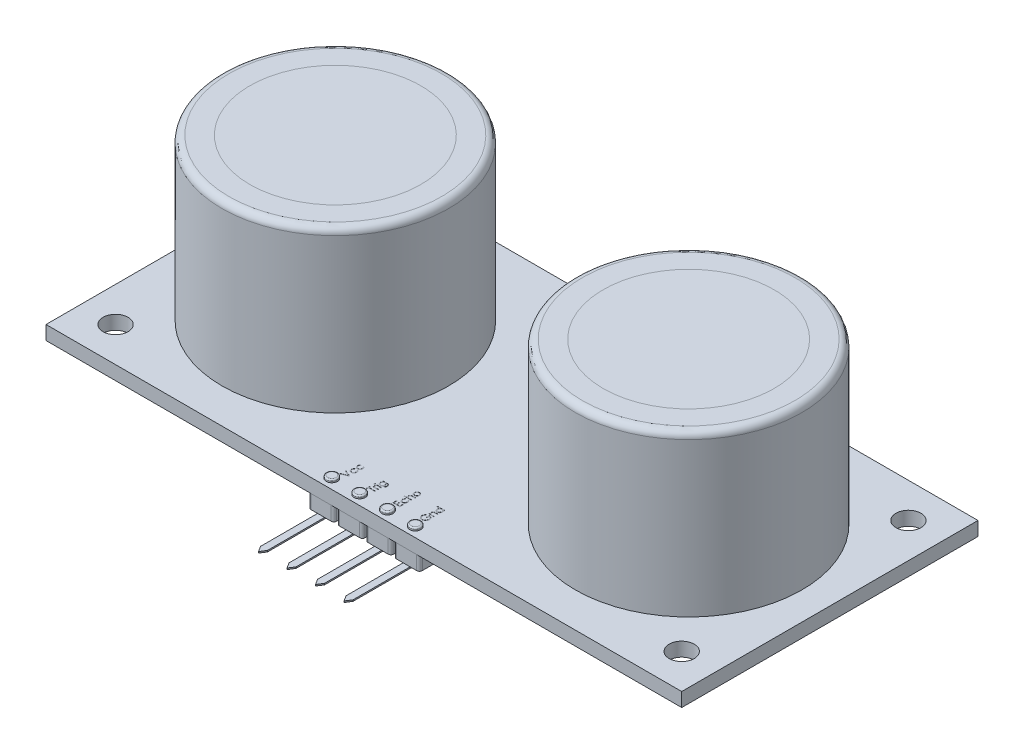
from build123d import *

# Parameters (mm, degrees)
SKETCH1_W              = 45.7
SKETCH1_H              = 21.3
SKETCH1_R              = 0.9
BOSS_EXTRUDE1_DEPTH    = 1
SKETCH2_R              = 8.15
SKETCH2_R_2            = 6.15
BOSS_EXTRUDE2_DEPTH    = 11.54
BOSS_EXTRUDE2_2_DEPTH  = 11.54
FILLET1_R              = 0.5
FILLET2_R              = 0.5
SKETCH3_R              = 6
BOSS_EXTRUDE3_DEPTH    = 7
BOSS_EXTRUDE3_2_DEPTH  = 7
LPATTERN2_COUNT        = 2
LPATTERN2_PITCH        = 25.4
SKETCH6_R              = 6.15
BOSS_EXTRUDE4_DEPTH    = 0.2
BOSS_EXTRUDE4_2_DEPTH  = 0.2
BOSS_EXTRUDE10_DEPTH   = 1
BOSS_EXTRUDE10_2_DEPTH = 1
BOSS_EXTRUDE10_3_DEPTH = 1
BOSS_EXTRUDE10_4_DEPTH = 1
SKETCH13_R             = 0.4
BOSS_EXTRUDE8_DEPTH    = 0.2
BOSS_EXTRUDE8_2_DEPTH  = 0.2
BOSS_EXTRUDE8_3_DEPTH  = 0.2
BOSS_EXTRUDE8_4_DEPTH  = 0.2
FILLET3_R              = 0.1
FILLET4_R              = 0.1
FILLET5_R              = 0.1
FILLET6_R              = 0.1
SKETCH15_W             = 0.365384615
SKETCH15_H             = 0.044871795
CUT_EXTRUDE5_DEPTH     = 0.01
BOSS_EXTRUDE11_DEPTH   = 0.1
BOSS_EXTRUDE11_2_DEPTH = 0.1
BOSS_EXTRUDE11_3_DEPTH = 0.1
BOSS_EXTRUDE11_4_DEPTH = 0.1
BOSS_EXTRUDE13_DEPTH   = 0.5
BOSS_EXTRUDE14_DEPTH   = 1.5
FILLET7_R              = 0.1


with BuildPart() as part:
    # Sketch1 → Boss-Extrude1 (new body)
    with BuildSketch(Plane(origin=(0, 0, 0), x_dir=(1, 0, 0), z_dir=(0, 1, 0))):
        Rectangle(SKETCH1_W, SKETCH1_H)
        with Locations(Location((20.35, 8.15, 0), (0, 0, 270))):
            Circle(SKETCH1_R, mode=Mode.SUBTRACT)
        with Locations(Location((-20.35, -8.15, 0), (0, 0, 270))):
            Circle(SKETCH1_R, mode=Mode.SUBTRACT)
        with Locations(Location((-20.35, 8.15, 0), (0, 0, 270))):
            Circle(SKETCH1_R, mode=Mode.SUBTRACT)
        with Locations(Location((20.35, -8.15, 0), (0, 0, 270))):
            Circle(SKETCH1_R, mode=Mode.SUBTRACT)
    extrude(amount=BOSS_EXTRUDE1_DEPTH)

    # Sketch15 → Cut-Extrude5 (cut)
    # profile 1 of 15: a face of its own
    with BuildSketch(Plane(origin=(0, 1, 0), x_dir=(1, 0, 0), z_dir=(0, 1, 0))):
        with BuildLine():
            Line((-2.771008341, -8.073076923), (-2.747671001, -8.110637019))
            add(Edge.make_bspline(
                [(-2.747671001, -8.110637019), (-2.752789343, -8.114755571), (-2.76286393, -8.122862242), (-2.775865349, -8.136939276), (-2.787032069, -8.151940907), (-2.796132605, -8.168123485), (-2.803164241, -8.185464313), (-2.808139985, -8.203895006), (-2.811240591, -8.223412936), (-2.811592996, -8.236793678), (-2.811773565, -8.24364984)],
                knots=[0, 0, 0, 0, 1.026593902, 2.0206758, 2.988051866, 3.946915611, 4.916868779, 5.907761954, 6.927957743, 8, 8, 8, 8], degree=3))
            add(Edge.make_bspline(
                [(-2.811773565, -8.24364984), (-2.811622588, -8.249129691), (-2.811325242, -8.259922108), (-2.8094666, -8.275765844), (-2.80608917, -8.290857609), (-2.801639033, -8.305291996), (-2.795674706, -8.318966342), (-2.78841617, -8.331916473), (-2.779980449, -8.344257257), (-2.770207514, -8.355631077), (-2.759579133, -8.366035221), (-2.748185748, -8.375049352), (-2.736368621, -8.382897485), (-2.723832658, -8.389055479), (-2.71086465, -8.394094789), (-2.697219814, -8.397410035), (-2.683072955, -8.399619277), (-2.673427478, -8.399872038), (-2.668544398, -8.4)],
                knots=[0, 0, 0, 0, 1.112346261, 2.190735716, 3.231507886, 4.247384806, 5.251966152, 6.253067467, 7.256802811, 8.280671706, 9.291813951, 10.270744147, 11.225547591, 12.165006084, 13.100104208, 14.043489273, 15.009504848, 16, 16, 16, 16], degree=3))
            add(Edge.make_bspline(
                [(-2.668544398, -8.4), (-2.662149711, -8.399741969), (-2.649413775, -8.399228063), (-2.630645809, -8.395319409), (-2.612533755, -8.388779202), (-2.595175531, -8.379943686), (-2.579092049, -8.368728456), (-2.564665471, -8.355562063), (-2.552177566, -8.340430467), (-2.541824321, -8.323468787), (-2.533501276, -8.305074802), (-2.527571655, -8.28544765), (-2.523992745, -8.26474768), (-2.523541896, -8.250575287), (-2.523312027, -8.243349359)],
                knots=[0, 0, 0, 0, 0.96628757, 1.924499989, 2.884001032, 3.87047137, 4.860396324, 5.839257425, 6.814467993, 7.816059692, 8.834901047, 9.858382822, 10.908076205, 12, 12, 12, 12], degree=3))
            add(Edge.make_bspline(
                [(-2.523312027, -8.243349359), (-2.523497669, -8.23672719), (-2.523862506, -8.22371287), (-2.526938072, -8.204688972), (-2.531972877, -8.186577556), (-2.53899397, -8.169379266), (-2.548069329, -8.153125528), (-2.559263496, -8.13792136), (-2.572254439, -8.123464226), (-2.582299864, -8.114964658), (-2.587414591, -8.110637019)],
                knots=[0, 0, 0, 0, 1.039848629, 2.043578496, 3.018386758, 3.987534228, 4.954977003, 5.934852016, 6.948509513, 8, 8, 8, 8], degree=3))
            Line((-2.587414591, -8.110637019), (-2.562775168, -8.073076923))
            add(Edge.make_bspline(
                [(-2.562775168, -8.073076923), (-2.559505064, -8.075303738), (-2.55297571, -8.079749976), (-2.543769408, -8.087182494), (-2.535152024, -8.095199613), (-2.527135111, -8.103770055), (-2.519526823, -8.112781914), (-2.512690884, -8.122543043), (-2.506243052, -8.132738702), (-2.500441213, -8.143488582), (-2.495226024, -8.154681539), (-2.490741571, -8.166301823), (-2.486888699, -8.178298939), (-2.483826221, -8.190686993), (-2.481381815, -8.203490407), (-2.479759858, -8.216676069), (-2.478549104, -8.230239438), (-2.478476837, -8.239406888), (-2.478440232, -8.244050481)],
                knots=[0, 0, 0, 0, 0.954134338, 1.905101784, 2.851144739, 3.791306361, 4.734911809, 5.6936923, 6.663572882, 7.643865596, 8.638447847, 9.640600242, 10.646758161, 11.676244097, 12.717260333, 13.78922464, 14.880174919, 16, 16, 16, 16], degree=3))
            add(Edge.make_bspline(
                [(-2.478440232, -8.244050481), (-2.478567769, -8.251137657), (-2.478817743, -8.265028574), (-2.481558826, -8.285361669), (-2.485706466, -8.304787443), (-2.491608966, -8.323340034), (-2.499403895, -8.340906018), (-2.508707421, -8.357631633), (-2.519826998, -8.373344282), (-2.532498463, -8.387940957), (-2.546251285, -8.401289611), (-2.561005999, -8.41290504), (-2.576436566, -8.422748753), (-2.592640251, -8.430857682), (-2.60955061, -8.437198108), (-2.627270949, -8.441563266), (-2.645650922, -8.444379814), (-2.658184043, -8.444706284), (-2.664537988, -8.444871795)],
                knots=[0, 0, 0, 0, 1.113096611, 2.181677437, 3.217994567, 4.231807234, 5.234933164, 6.233258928, 7.234764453, 8.254006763, 9.267004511, 10.242118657, 11.199842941, 12.138404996, 13.084707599, 14.031460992, 15.002005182, 16, 16, 16, 16], degree=3))
            add(Edge.make_bspline(
                [(-2.664537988, -8.444871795), (-2.668849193, -8.444808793), (-2.677424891, -8.444683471), (-2.690152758, -8.443246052), (-2.702711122, -8.441389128), (-2.714940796, -8.438242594), (-2.727027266, -8.434608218), (-2.738824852, -8.429968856), (-2.750388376, -8.424526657), (-2.761688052, -8.418347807), (-2.772537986, -8.411392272), (-2.78278851, -8.403694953), (-2.792562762, -8.395545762), (-2.801523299, -8.386563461), (-2.810028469, -8.377129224), (-2.817851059, -8.366976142), (-2.825014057, -8.356162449), (-2.831649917, -8.344850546), (-2.837558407, -8.333047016), (-2.84264887, -8.320823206), (-2.846999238, -8.308252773), (-2.850443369, -8.295315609), (-2.853331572, -8.282097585), (-2.855148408, -8.268494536), (-2.856432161, -8.254558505), (-2.856573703, -8.24512193), (-2.85664536, -8.240344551)],
                knots=[0, 0, 0, 0, 0.990994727, 1.971252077, 2.943264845, 3.907940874, 4.872158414, 5.844625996, 6.82015047, 7.809835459, 8.804511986, 9.781214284, 10.756496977, 11.728388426, 12.696359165, 13.676225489, 14.672885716, 15.677705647, 16.690706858, 17.706033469, 18.721040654, 19.747369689, 20.783475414, 21.830280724, 22.901553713, 24, 24, 24, 24], degree=3))
            add(Edge.make_bspline(
                [(-2.85664536, -8.240344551), (-2.856513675, -8.234361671), (-2.856250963, -8.222425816), (-2.854039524, -8.204720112), (-2.850706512, -8.187274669), (-2.84576471, -8.170398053), (-2.839794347, -8.154285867), (-2.833049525, -8.139243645), (-2.825383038, -8.125498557), (-2.816841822, -8.112929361), (-2.807112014, -8.101539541), (-2.796292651, -8.091037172), (-2.784305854, -8.081353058), (-2.775477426, -8.075858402), (-2.771008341, -8.073076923)],
                knots=[0, 0, 0, 0, 1.095139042, 2.184804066, 3.262657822, 4.34424993, 5.400369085, 6.407210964, 7.359649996, 8.278719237, 9.185177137, 10.097389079, 11.036869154, 12, 12, 12, 12], degree=3))
        make_face()
    # profile 2 of 15: a face of its own
    with BuildSketch(Plane(origin=(0, 1, 0), x_dir=(1, 0, 0), z_dir=(0, 1, 0))):
        with BuildLine():
            Line((-2.771008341, -8.521794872), (-2.747671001, -8.559354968))
            add(Edge.make_bspline(
                [(-2.747671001, -8.559354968), (-2.752789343, -8.56347352), (-2.76286393, -8.571580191), (-2.775865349, -8.585657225), (-2.787032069, -8.600658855), (-2.796132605, -8.616841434), (-2.803164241, -8.634182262), (-2.808139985, -8.652612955), (-2.811240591, -8.672130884), (-2.811592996, -8.685511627), (-2.811773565, -8.692367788)],
                knots=[0, 0, 0, 0, 1.026593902, 2.0206758, 2.988051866, 3.946915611, 4.916868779, 5.907761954, 6.927957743, 8, 8, 8, 8], degree=3))
            add(Edge.make_bspline(
                [(-2.811773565, -8.692367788), (-2.811622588, -8.697847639), (-2.811325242, -8.708640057), (-2.8094666, -8.724483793), (-2.80608917, -8.739575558), (-2.801639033, -8.754009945), (-2.795674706, -8.76768429), (-2.78841617, -8.780634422), (-2.779980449, -8.792975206), (-2.770207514, -8.804349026), (-2.759579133, -8.81475317), (-2.748185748, -8.823767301), (-2.736368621, -8.831615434), (-2.723832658, -8.837773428), (-2.71086465, -8.842812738), (-2.697219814, -8.846127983), (-2.683072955, -8.848337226), (-2.673427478, -8.848589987), (-2.668544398, -8.848717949)],
                knots=[0, 0, 0, 0, 1.112346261, 2.190735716, 3.231507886, 4.247384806, 5.251966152, 6.253067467, 7.256802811, 8.280671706, 9.291813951, 10.270744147, 11.225547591, 12.165006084, 13.100104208, 14.043489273, 15.009504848, 16, 16, 16, 16], degree=3))
            add(Edge.make_bspline(
                [(-2.668544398, -8.848717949), (-2.662149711, -8.848459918), (-2.649413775, -8.847946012), (-2.630645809, -8.844037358), (-2.612533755, -8.837497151), (-2.595175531, -8.828661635), (-2.579092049, -8.817446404), (-2.564665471, -8.804280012), (-2.552177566, -8.789148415), (-2.541824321, -8.772186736), (-2.533501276, -8.75379275), (-2.527571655, -8.734165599), (-2.523992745, -8.713465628), (-2.523541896, -8.699293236), (-2.523312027, -8.692067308)],
                knots=[0, 0, 0, 0, 0.96628757, 1.924499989, 2.884001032, 3.87047137, 4.860396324, 5.839257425, 6.814467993, 7.816059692, 8.834901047, 9.858382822, 10.908076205, 12, 12, 12, 12], degree=3))
            add(Edge.make_bspline(
                [(-2.523312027, -8.692067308), (-2.523497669, -8.685445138), (-2.523862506, -8.672430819), (-2.526938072, -8.653406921), (-2.531972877, -8.635295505), (-2.53899397, -8.618097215), (-2.548069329, -8.601843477), (-2.559263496, -8.586639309), (-2.572254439, -8.572182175), (-2.582299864, -8.563682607), (-2.587414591, -8.559354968)],
                knots=[0, 0, 0, 0, 1.039848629, 2.043578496, 3.018386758, 3.987534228, 4.954977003, 5.934852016, 6.948509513, 8, 8, 8, 8], degree=3))
            Line((-2.587414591, -8.559354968), (-2.562775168, -8.521794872))
            add(Edge.make_bspline(
                [(-2.562775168, -8.521794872), (-2.559505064, -8.524021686), (-2.55297571, -8.528467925), (-2.543769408, -8.535900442), (-2.535152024, -8.543917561), (-2.527135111, -8.552488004), (-2.519526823, -8.561499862), (-2.512690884, -8.571260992), (-2.506243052, -8.581456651), (-2.500441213, -8.592206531), (-2.495226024, -8.603399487), (-2.490741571, -8.615019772), (-2.486888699, -8.627016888), (-2.483826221, -8.639404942), (-2.481381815, -8.652208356), (-2.479759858, -8.665394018), (-2.478549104, -8.678957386), (-2.478476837, -8.688124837), (-2.478440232, -8.692768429)],
                knots=[0, 0, 0, 0, 0.954134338, 1.905101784, 2.851144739, 3.791306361, 4.734911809, 5.6936923, 6.663572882, 7.643865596, 8.638447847, 9.640600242, 10.646758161, 11.676244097, 12.717260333, 13.78922464, 14.880174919, 16, 16, 16, 16], degree=3))
            add(Edge.make_bspline(
                [(-2.478440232, -8.692768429), (-2.478567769, -8.699855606), (-2.478817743, -8.713746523), (-2.481558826, -8.734079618), (-2.485706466, -8.753505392), (-2.491608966, -8.772057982), (-2.499403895, -8.789623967), (-2.508707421, -8.806349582), (-2.519826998, -8.82206223), (-2.532498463, -8.836658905), (-2.546251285, -8.85000756), (-2.561005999, -8.861622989), (-2.576436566, -8.871466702), (-2.592640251, -8.879575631), (-2.60955061, -8.885916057), (-2.627270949, -8.890281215), (-2.645650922, -8.893097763), (-2.658184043, -8.893424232), (-2.664537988, -8.893589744)],
                knots=[0, 0, 0, 0, 1.113096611, 2.181677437, 3.217994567, 4.231807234, 5.234933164, 6.233258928, 7.234764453, 8.254006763, 9.267004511, 10.242118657, 11.199842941, 12.138404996, 13.084707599, 14.031460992, 15.002005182, 16, 16, 16, 16], degree=3))
            add(Edge.make_bspline(
                [(-2.664537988, -8.893589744), (-2.668849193, -8.893526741), (-2.677424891, -8.893401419), (-2.690152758, -8.891964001), (-2.702711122, -8.890107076), (-2.714940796, -8.886960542), (-2.727027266, -8.883326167), (-2.738824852, -8.878686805), (-2.750388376, -8.873244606), (-2.761688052, -8.867065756), (-2.772537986, -8.860110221), (-2.78278851, -8.852412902), (-2.792562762, -8.844263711), (-2.801523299, -8.835281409), (-2.810028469, -8.825847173), (-2.817851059, -8.815694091), (-2.825014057, -8.804880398), (-2.831649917, -8.793568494), (-2.837558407, -8.781764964), (-2.84264887, -8.769541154), (-2.846999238, -8.756970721), (-2.850443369, -8.744033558), (-2.853331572, -8.730815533), (-2.855148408, -8.717212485), (-2.856432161, -8.703276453), (-2.856573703, -8.693839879), (-2.85664536, -8.6890625)],
                knots=[0, 0, 0, 0, 0.990994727, 1.971252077, 2.943264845, 3.907940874, 4.872158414, 5.844625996, 6.82015047, 7.809835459, 8.804511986, 9.781214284, 10.756496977, 11.728388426, 12.696359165, 13.676225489, 14.672885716, 15.677705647, 16.690706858, 17.706033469, 18.721040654, 19.747369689, 20.783475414, 21.830280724, 22.901553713, 24, 24, 24, 24], degree=3))
            add(Edge.make_bspline(
                [(-2.85664536, -8.6890625), (-2.856513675, -8.68307962), (-2.856250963, -8.671143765), (-2.854039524, -8.65343806), (-2.850706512, -8.635992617), (-2.84576471, -8.619116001), (-2.839794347, -8.603003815), (-2.833049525, -8.587961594), (-2.825383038, -8.574216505), (-2.816841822, -8.561647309), (-2.807112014, -8.550257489), (-2.796292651, -8.539755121), (-2.784305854, -8.530071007), (-2.775477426, -8.524576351), (-2.771008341, -8.521794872)],
                knots=[0, 0, 0, 0, 1.095139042, 2.184804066, 3.262657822, 4.34424993, 5.400369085, 6.407210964, 7.359649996, 8.278719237, 9.185177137, 10.097389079, 11.036869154, 12, 12, 12, 12], degree=3))
        make_face()
    # profile 3 of 15: a face of its own
    with BuildSketch(Plane(origin=(0, 1, 0), x_dir=(1, 0, 0), z_dir=(0, 1, 0))):
        Polygon((-2.984850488, -9.393589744), (-2.984850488, -9.345512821), (-2.590820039, -9.178846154), (-2.984850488, -9.012179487), (-2.984850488, -8.964102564), (-2.484850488, -9.175641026), (-2.484850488, -9.182051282), align=None)
    # profile 4 of 15: a face of its own
    with BuildSketch(Plane(origin=(0, 1, 0), x_dir=(1, 0, 0), z_dir=(0, 1, 0))):
        with BuildLine():
            Line((-0.997671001, -8.323076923), (-0.997671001, -8.278205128))
            Line((-0.997671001, -8.278205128), (-0.707707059, -8.278205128))
            add(Edge.make_bspline(
                [(-0.707707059, -8.278205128), (-0.701530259, -8.278244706), (-0.689607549, -8.2783211), (-0.672367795, -8.278871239), (-0.656444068, -8.280031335), (-0.641763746, -8.281346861), (-0.628394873, -8.283239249), (-0.616297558, -8.285550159), (-0.605460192, -8.288155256), (-0.598785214, -8.290443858), (-0.595627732, -8.291526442)],
                knots=[0, 0, 0, 0, 1.307562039, 2.523909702, 3.650326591, 4.686913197, 5.643429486, 6.506965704, 7.293745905, 8, 8, 8, 8], degree=3))
            add(Edge.make_bspline(
                [(-0.595627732, -8.291526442), (-0.591523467, -8.293124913), (-0.583437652, -8.29627406), (-0.571975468, -8.302171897), (-0.561183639, -8.308777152), (-0.551119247, -8.316319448), (-0.54184421, -8.324773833), (-0.533128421, -8.333892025), (-0.525299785, -8.343993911), (-0.518264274, -8.354902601), (-0.511803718, -8.366397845), (-0.50629187, -8.378566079), (-0.501694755, -8.391341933), (-0.497912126, -8.404666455), (-0.494860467, -8.418538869), (-0.492824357, -8.433005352), (-0.49145333, -8.448017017), (-0.491325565, -8.458223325), (-0.491260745, -8.463401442)],
                knots=[0, 0, 0, 0, 0.98202571, 1.934689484, 2.871054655, 3.802072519, 4.735470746, 5.668036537, 6.612630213, 7.581518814, 8.561763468, 9.551722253, 10.55777311, 11.588015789, 12.63986657, 13.723744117, 14.845153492, 16, 16, 16, 16], degree=3))
            add(Edge.make_bspline(
                [(-0.491260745, -8.463401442), (-0.491398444, -8.470954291), (-0.491667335, -8.485703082), (-0.494237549, -8.507250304), (-0.498383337, -8.527647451), (-0.504290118, -8.546745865), (-0.51159439, -8.564353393), (-0.519961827, -8.580371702), (-0.529561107, -8.594653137), (-0.540489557, -8.607527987), (-0.553484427, -8.619148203), (-0.56879853, -8.630080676), (-0.586665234, -8.640603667), (-0.599778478, -8.646770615), (-0.60664536, -8.65)],
                knots=[0, 0, 0, 0, 1.157856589, 2.260999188, 3.322382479, 4.345906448, 5.321474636, 6.242187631, 7.112686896, 7.955149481, 8.825136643, 9.778649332, 10.836767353, 12, 12, 12, 12], degree=3))
            Line((-0.60664536, -8.65), (-0.60664536, -8.605128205))
            add(Edge.make_bspline(
                [(-0.60664536, -8.605128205), (-0.600917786, -8.601517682), (-0.589721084, -8.594459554), (-0.575209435, -8.581304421), (-0.562921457, -8.566781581), (-0.552951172, -8.55058289), (-0.545275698, -8.53259537), (-0.539944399, -8.512702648), (-0.536718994, -8.490850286), (-0.536333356, -8.475632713), (-0.536132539, -8.467708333)],
                knots=[0, 0, 0, 0, 0.997887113, 1.950746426, 2.877762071, 3.798308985, 4.747694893, 5.754452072, 6.830656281, 8, 8, 8, 8], degree=3))
            add(Edge.make_bspline(
                [(-0.536132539, -8.467708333), (-0.536335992, -8.459884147), (-0.536728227, -8.4447999), (-0.53994568, -8.423114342), (-0.545277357, -8.403286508), (-0.552935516, -8.38553539), (-0.562134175, -8.369971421), (-0.57230764, -8.356477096), (-0.583915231, -8.345633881), (-0.594592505, -8.338312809), (-0.604111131, -8.333766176), (-0.61230383, -8.330868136), (-0.621538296, -8.328530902), (-0.631836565, -8.326524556), (-0.643202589, -8.324934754), (-0.65567513, -8.323891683), (-0.669169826, -8.323151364), (-0.678525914, -8.32310231), (-0.683368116, -8.323076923)],
                knots=[0, 0, 0, 0, 1.570880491, 3.028500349, 4.391799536, 5.683507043, 6.897971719, 8.016608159, 9.065046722, 10.074948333, 10.602832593, 11.179761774, 11.817338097, 12.514350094, 13.286299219, 14.121078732, 15.027572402, 16, 16, 16, 16], degree=3))
            Line((-0.683368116, -8.323076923), (-0.702298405, -8.323076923))
            add(Edge.make_bspline(
                [(-0.702298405, -8.323076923), (-0.696880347, -8.327632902), (-0.686139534, -8.336664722), (-0.672040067, -8.3522204), (-0.660043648, -8.369318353), (-0.650065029, -8.387716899), (-0.642159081, -8.407141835), (-0.636430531, -8.427249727), (-0.632877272, -8.447984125), (-0.632484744, -8.462018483), (-0.632286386, -8.469110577)],
                knots=[0, 0, 0, 0, 1.012670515, 2.007528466, 2.995541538, 3.996581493, 4.997861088, 5.991949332, 6.98525577, 8, 8, 8, 8], degree=3))
            add(Edge.make_bspline(
                [(-0.632286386, -8.469110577), (-0.632374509, -8.473285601), (-0.632549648, -8.481583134), (-0.63361503, -8.493945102), (-0.635689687, -8.506068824), (-0.638346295, -8.51803153), (-0.641907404, -8.529749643), (-0.646087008, -8.54136357), (-0.651220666, -8.552704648), (-0.657000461, -8.563830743), (-0.663494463, -8.574480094), (-0.670510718, -8.584619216), (-0.67803427, -8.594185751), (-0.686133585, -8.603091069), (-0.694798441, -8.611322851), (-0.703936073, -8.618991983), (-0.713674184, -8.625971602), (-0.723835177, -8.632404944), (-0.734486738, -8.637984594), (-0.745397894, -8.642882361), (-0.756545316, -8.647140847), (-0.767966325, -8.650535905), (-0.779653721, -8.653128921), (-0.791588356, -8.655058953), (-0.803806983, -8.656153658), (-0.812038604, -8.656324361), (-0.816180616, -8.656410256)],
                knots=[0, 0, 0, 0, 1.028710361, 2.044481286, 3.053267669, 4.056977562, 5.061496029, 6.068537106, 7.095799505, 8.125955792, 9.155750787, 10.166547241, 11.162135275, 12.151998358, 13.129411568, 14.10464185, 15.088574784, 16.079052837, 17.065149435, 18.048153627, 19.024354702, 20.002874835, 20.980703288, 21.971932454, 22.97951087, 24, 24, 24, 24], degree=3))
            add(Edge.make_bspline(
                [(-0.816180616, -8.656410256), (-0.820323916, -8.65633609), (-0.828594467, -8.656188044), (-0.840862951, -8.654909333), (-0.852967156, -8.653085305), (-0.864782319, -8.650198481), (-0.876442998, -8.646723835), (-0.887863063, -8.642420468), (-0.899045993, -8.637246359), (-0.910000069, -8.631387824), (-0.920578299, -8.624804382), (-0.930624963, -8.617585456), (-0.94006613, -8.609722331), (-0.948997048, -8.601323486), (-0.957331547, -8.592286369), (-0.965049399, -8.582615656), (-0.972279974, -8.572406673), (-0.978867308, -8.56162778), (-0.984693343, -8.550445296), (-0.990009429, -8.539143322), (-0.994228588, -8.527572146), (-0.997946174, -8.515947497), (-1.000579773, -8.504064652), (-1.002611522, -8.49206931), (-1.003849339, -8.479920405), (-1.004003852, -8.471784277), (-1.004081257, -8.467708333)],
                knots=[0, 0, 0, 0, 1.008818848, 2.013730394, 3.001654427, 3.987803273, 4.973046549, 5.963777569, 6.957074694, 7.972068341, 8.987420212, 9.989399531, 10.982630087, 11.977756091, 12.973280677, 13.973972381, 14.989194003, 16.018387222, 17.047741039, 18.059210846, 19.057554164, 20.045176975, 21.029480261, 22.018708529, 23.007435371, 24, 24, 24, 24], degree=3))
            add(Edge.make_bspline(
                [(-1.004081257, -8.467708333), (-1.003887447, -8.460986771), (-1.003504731, -8.44771375), (-1.00050171, -8.428180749), (-0.995713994, -8.409331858), (-0.988854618, -8.391060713), (-0.979490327, -8.373218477), (-0.96715562, -8.355863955), (-0.951739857, -8.338946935), (-0.939918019, -8.328507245), (-0.933768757, -8.323076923)],
                knots=[0, 0, 0, 0, 0.96728863, 1.910097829, 2.838038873, 3.762875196, 4.71315279, 5.730631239, 6.819562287, 8, 8, 8, 8], degree=3))
            Line((-0.933768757, -8.323076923), (-0.997671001, -8.323076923))
        make_face()
        with BuildLine():
            add(Edge.make_bspline(
                [(-0.959209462, -8.464102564), (-0.958985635, -8.470663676), (-0.958542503, -8.483653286), (-0.954785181, -8.502700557), (-0.948838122, -8.521046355), (-0.940560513, -8.538509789), (-0.930099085, -8.55468857), (-0.917652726, -8.569167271), (-0.903392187, -8.581790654), (-0.887501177, -8.592471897), (-0.87033042, -8.601004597), (-0.852239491, -8.606965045), (-0.83354441, -8.610904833), (-0.820807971, -8.611325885), (-0.814377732, -8.611538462)],
                knots=[0, 0, 0, 0, 1.026191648, 2.031641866, 3.026511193, 4.038688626, 5.047555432, 6.033268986, 7.01798463, 8.019529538, 9.022150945, 10.008736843, 10.994672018, 12, 12, 12, 12], degree=3))
            add(Edge.make_bspline(
                [(-0.814377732, -8.611538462), (-0.809530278, -8.611434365), (-0.799996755, -8.611229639), (-0.786003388, -8.609275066), (-0.772655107, -8.606077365), (-0.759964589, -8.601659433), (-0.747930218, -8.59601418), (-0.736552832, -8.589051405), (-0.725826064, -8.58080999), (-0.71584043, -8.571403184), (-0.70674619, -8.561034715), (-0.698754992, -8.549789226), (-0.692219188, -8.537681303), (-0.686570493, -8.52500891), (-0.682444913, -8.511464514), (-0.679296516, -8.497243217), (-0.677495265, -8.482244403), (-0.677272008, -8.472019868), (-0.67715818, -8.466806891)],
                knots=[0, 0, 0, 0, 1.039710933, 2.044807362, 3.024849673, 3.981007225, 4.923240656, 5.871799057, 6.837597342, 7.820855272, 8.810901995, 9.792827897, 10.773995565, 11.758948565, 12.765014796, 13.806304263, 14.881544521, 16, 16, 16, 16], degree=3))
            add(Edge.make_bspline(
                [(-0.67715818, -8.466806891), (-0.677267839, -8.461526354), (-0.677482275, -8.45120032), (-0.679325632, -8.436118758), (-0.6823002, -8.421828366), (-0.686523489, -8.408342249), (-0.691912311, -8.395609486), (-0.698731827, -8.383773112), (-0.706498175, -8.372579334), (-0.715557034, -8.362385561), (-0.725540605, -8.353167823), (-0.736404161, -8.345134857), (-0.747984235, -8.338289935), (-0.760279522, -8.332621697), (-0.773385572, -8.328294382), (-0.787269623, -8.325391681), (-0.801865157, -8.323362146), (-0.811866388, -8.323173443), (-0.816981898, -8.323076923)],
                knots=[0, 0, 0, 0, 1.121943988, 2.193949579, 3.223793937, 4.220241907, 5.192961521, 6.155822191, 7.11847367, 8.083710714, 9.04790392, 10.001595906, 10.949595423, 11.902125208, 12.873731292, 13.87582262, 14.913508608, 16, 16, 16, 16], degree=3))
            add(Edge.make_bspline(
                [(-0.816981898, -8.323076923), (-0.82364145, -8.323268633), (-0.836651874, -8.323643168), (-0.85561197, -8.327166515), (-0.873457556, -8.33288198), (-0.890142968, -8.34081413), (-0.905435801, -8.350799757), (-0.918948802, -8.362944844), (-0.931054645, -8.376711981), (-0.941008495, -8.392437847), (-0.949122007, -8.409269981), (-0.955011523, -8.426960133), (-0.958478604, -8.445337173), (-0.958964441, -8.457811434), (-0.959209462, -8.464102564)],
                knots=[0, 0, 0, 0, 1.070678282, 2.091729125, 3.090678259, 4.078281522, 5.055707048, 6.018451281, 6.993304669, 7.996175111, 9.002951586, 9.993356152, 10.987991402, 12, 12, 12, 12], degree=3))
        make_face(mode=Mode.SUBTRACT)
    # profile 5 of 15: a face of its own
    with BuildSketch(Plane(origin=(0, 1, 0), x_dir=(1, 0, 0), z_dir=(0, 1, 0))):
        with BuildLine():
            add(Edge.make_bspline(
                [(-1.151517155, -8.768790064), (-1.15138799, -8.76600559), (-1.151135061, -8.760553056), (-1.148969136, -8.752668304), (-1.145297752, -8.74548873), (-1.140372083, -8.739120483), (-1.134579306, -8.733655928), (-1.127827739, -8.729830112), (-1.120533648, -8.727371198), (-1.115445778, -8.727074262), (-1.112855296, -8.726923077)],
                knots=[0, 0, 0, 0, 1.055194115, 2.066272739, 3.074728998, 4.095836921, 5.109056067, 6.073838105, 7.019297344, 8, 8, 8, 8], degree=3))
            add(Edge.make_bspline(
                [(-1.112855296, -8.726923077), (-1.11033206, -8.727077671), (-1.10534392, -8.727383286), (-1.098176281, -8.729828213), (-1.091518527, -8.733688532), (-1.085736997, -8.739116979), (-1.080814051, -8.745489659), (-1.077141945, -8.752668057), (-1.074976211, -8.760553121), (-1.074723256, -8.766005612), (-1.074594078, -8.768790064)],
                knots=[0, 0, 0, 0, 0.96129708, 1.900370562, 2.859976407, 3.87933698, 4.906634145, 5.921202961, 6.938410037, 8, 8, 8, 8], degree=3))
            add(Edge.make_bspline(
                [(-1.074594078, -8.768790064), (-1.074718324, -8.771542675), (-1.074960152, -8.776900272), (-1.07718444, -8.784666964), (-1.080815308, -8.791785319), (-1.085704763, -8.798165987), (-1.091554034, -8.803484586), (-1.098172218, -8.807355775), (-1.105344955, -8.809795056), (-1.110332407, -8.810101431), (-1.112855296, -8.81025641)],
                knots=[0, 0, 0, 0, 1.054934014, 2.053291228, 3.073705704, 4.106921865, 5.123545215, 6.088680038, 7.033164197, 8, 8, 8, 8], degree=3))
            add(Edge.make_bspline(
                [(-1.112855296, -8.81025641), (-1.115445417, -8.810104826), (-1.120532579, -8.809807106), (-1.127831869, -8.807353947), (-1.134543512, -8.803516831), (-1.140404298, -8.798162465), (-1.145296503, -8.791786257), (-1.148926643, -8.784666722), (-1.15115112, -8.776900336), (-1.151392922, -8.771542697), (-1.151517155, -8.768790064)],
                knots=[0, 0, 0, 0, 0.98631895, 1.937192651, 2.907499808, 3.917963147, 4.944918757, 5.95915025, 6.951458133, 8, 8, 8, 8], degree=3))
        make_face()
    # profile 6 of 15: a face of its own
    with BuildSketch(Plane(origin=(0, 1, 0), x_dir=(1, 0, 0), z_dir=(0, 1, 0))):
        with Locations((-0.814978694, -8.768589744)):
            Rectangle(SKETCH15_W, SKETCH15_H)
    # profile 7 of 15: a face of its own
    with BuildSketch(Plane(origin=(0, 1, 0), x_dir=(1, 0, 0), z_dir=(0, 1, 0))):
        with BuildLine():
            Line((-0.997671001, -9.008974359), (-0.997671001, -8.964102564))
            Line((-0.997671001, -8.964102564), (-0.943884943, -8.964102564))
            add(Edge.make_bspline(
                [(-0.943884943, -8.964102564), (-0.948895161, -8.960792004), (-0.958477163, -8.954460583), (-0.971132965, -8.943887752), (-0.98173113, -8.933173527), (-0.990069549, -8.922036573), (-0.996371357, -8.910586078), (-1.00079944, -8.898918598), (-1.003545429, -8.887005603), (-1.003902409, -8.878980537), (-1.004081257, -8.874959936)],
                knots=[0, 0, 0, 0, 1.280091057, 2.448164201, 3.510831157, 4.48793739, 5.405868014, 6.289422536, 7.142991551, 8, 8, 8, 8], degree=3))
            add(Edge.make_bspline(
                [(-1.004081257, -8.874959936), (-1.003911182, -8.871841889), (-1.003561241, -8.865426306), (-1.001102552, -8.855714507), (-0.99717712, -8.8457083), (-0.99348566, -8.839259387), (-0.991561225, -8.835897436)],
                knots=[0, 0, 0, 0, 0.901110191, 1.854092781, 2.881294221, 4, 4, 4, 4], degree=3))
            Line((-0.991561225, -8.835897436), (-0.952699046, -8.860536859))
            add(Edge.make_bspline(
                [(-0.952699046, -8.860536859), (-0.953661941, -8.862695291), (-0.9554897, -8.866792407), (-0.957652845, -8.872785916), (-0.958926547, -8.878311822), (-0.959119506, -8.88183233), (-0.959209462, -8.883473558)],
                knots=[0, 0, 0, 0, 1.180555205, 2.24091978, 3.179933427, 4, 4, 4, 4], degree=3))
            add(Edge.make_bspline(
                [(-0.959209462, -8.883473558), (-0.958971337, -8.887075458), (-0.958485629, -8.89442229), (-0.954612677, -8.905172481), (-0.948535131, -8.915697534), (-0.941614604, -8.923975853), (-0.934966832, -8.930408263), (-0.929148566, -8.935034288), (-0.922564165, -8.939186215), (-0.915468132, -8.943213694), (-0.907682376, -8.946955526), (-0.899194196, -8.950299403), (-0.890073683, -8.953426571), (-0.883731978, -8.955187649), (-0.880483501, -8.956089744)],
                knots=[0, 0, 0, 0, 1.125322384, 2.295331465, 3.535939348, 4.916963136, 5.656144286, 6.429838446, 7.238666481, 8.090384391, 8.983239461, 9.940052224, 10.944811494, 12, 12, 12, 12], degree=3))
            add(Edge.make_bspline(
                [(-0.880483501, -8.956089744), (-0.877586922, -8.956766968), (-0.871139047, -8.958274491), (-0.860370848, -8.959701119), (-0.847656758, -8.961167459), (-0.832982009, -8.962168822), (-0.81629019, -8.963114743), (-0.79765331, -8.963637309), (-0.777020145, -8.964085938), (-0.762628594, -8.964096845), (-0.75508286, -8.964102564)],
                knots=[0, 0, 0, 0, 0.566841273, 1.261806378, 2.068780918, 3.007109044, 4.065315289, 5.256255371, 6.561408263, 8, 8, 8, 8], degree=3))
            Line((-0.75508286, -8.964102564), (-0.632286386, -8.964102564))
            Line((-0.632286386, -8.964102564), (-0.632286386, -9.008974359))
            Line((-0.632286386, -9.008974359), (-0.997671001, -9.008974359))
        make_face()
    # profile 8 of 15: a face of its own
    with BuildSketch(Plane(origin=(0, 1, 0), x_dir=(1, 0, 0), z_dir=(0, 1, 0))):
        Polygon((-1.081004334, -9.335897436), (-1.132286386, -9.335897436), (-1.132286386, -9.073076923), (-1.081004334, -9.073076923), (-1.081004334, -9.182051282), (-0.632286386, -9.182051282), (-0.632286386, -9.226923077), (-1.081004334, -9.226923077), align=None)
    # profile 9 of 15: a face of its own
    with BuildSketch(Plane(origin=(0, 1, 0), x_dir=(1, 0, 0), z_dir=(0, 1, 0))):
        with BuildLine():
            add(Edge.make_bspline(
                [(0.848482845, -7.877363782), (0.84862883, -7.870507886), (0.84891507, -7.857065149), (0.85197435, -7.837378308), (0.856652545, -7.818586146), (0.863119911, -7.80061669), (0.871788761, -7.783700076), (0.882132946, -7.767589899), (0.894387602, -7.752330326), (0.903867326, -7.743184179), (0.908679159, -7.738541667)],
                knots=[0, 0, 0, 0, 1.054011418, 2.066658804, 3.057071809, 4.030435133, 4.997543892, 5.974964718, 6.972108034, 8, 8, 8, 8], degree=3))
            add(Edge.make_bspline(
                [(0.908679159, -7.738541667), (0.913281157, -7.734544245), (0.922396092, -7.726626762), (0.937175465, -7.716474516), (0.952481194, -7.707728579), (0.968516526, -7.700719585), (0.985141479, -7.695193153), (1.002413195, -7.691269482), (1.02029353, -7.688935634), (1.032436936, -7.688620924), (1.038587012, -7.688461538)],
                knots=[0, 0, 0, 0, 1.025258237, 2.030674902, 3.01204498, 3.988269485, 4.97094183, 5.956517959, 6.965070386, 8, 8, 8, 8], degree=3))
            add(Edge.make_bspline(
                [(1.038587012, -7.688461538), (1.044772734, -7.68860173), (1.056996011, -7.688878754), (1.074998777, -7.69149927), (1.09245518, -7.69557514), (1.109292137, -7.701408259), (1.125561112, -7.708887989), (1.141191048, -7.71801523), (1.156212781, -7.728854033), (1.170498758, -7.741140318), (1.18366536, -7.754719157), (1.195140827, -7.769450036), (1.204972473, -7.785043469), (1.212891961, -7.801706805), (1.219136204, -7.819287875), (1.223521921, -7.837824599), (1.22617359, -7.85728818), (1.2265141, -7.870577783), (1.226687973, -7.877363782)],
                knots=[0, 0, 0, 0, 0.998656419, 1.973391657, 2.932242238, 3.890759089, 4.846373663, 5.82037756, 6.809684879, 7.83454468, 8.860553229, 9.859544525, 10.845671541, 11.83227036, 12.833544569, 13.85385346, 14.904124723, 16, 16, 16, 16], degree=3))
            add(Edge.make_bspline(
                [(1.226687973, -7.877363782), (1.226513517, -7.884183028), (1.226171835, -7.897538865), (1.223532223, -7.917071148), (1.219138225, -7.935641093), (1.212871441, -7.953245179), (1.20497222, -7.969980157), (1.19517055, -7.985663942), (1.183661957, -8.000406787), (1.17049968, -8.0139885), (1.156212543, -8.026274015), (1.141191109, -8.037113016), (1.125561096, -8.046240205), (1.109292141, -8.053719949), (1.092455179, -8.059553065), (1.074998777, -8.063628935), (1.056996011, -8.066249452), (1.044772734, -8.066526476), (1.038587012, -8.066666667)],
                knots=[0, 0, 0, 0, 1.099876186, 2.154163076, 3.173186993, 4.173200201, 5.163417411, 6.152872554, 7.150605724, 8.17532212, 9.198891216, 10.186952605, 11.159729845, 12.11414092, 13.071450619, 14.029093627, 15.002601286, 16, 16, 16, 16], degree=3))
            add(Edge.make_bspline(
                [(1.038587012, -8.066666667), (1.032470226, -8.066506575), (1.020360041, -8.066189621), (1.002515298, -8.063852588), (0.985296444, -8.05997161), (0.968762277, -8.054368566), (0.952765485, -8.047372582), (0.937403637, -8.038714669), (0.922688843, -8.028464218), (0.913585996, -8.020577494), (0.90897964, -8.016586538)],
                knots=[0, 0, 0, 0, 1.031377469, 2.041950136, 3.029500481, 4.003457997, 4.981637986, 5.969878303, 6.97268806, 8, 8, 8, 8], degree=3))
            add(Edge.make_bspline(
                [(0.90897964, -8.016586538), (0.904126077, -8.011951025), (0.894580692, -8.002834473), (0.88236176, -7.987498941), (0.871802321, -7.971428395), (0.863305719, -7.954324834), (0.856614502, -7.93637014), (0.851962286, -7.917481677), (0.848926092, -7.897728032), (0.848632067, -7.884219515), (0.848482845, -7.877363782)],
                knots=[0, 0, 0, 0, 1.027980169, 2.021703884, 2.998553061, 3.971491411, 4.943284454, 5.930300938, 6.949603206, 8, 8, 8, 8], degree=3))
        make_face()
        with BuildLine():
            add(Edge.make_bspline(
                [(0.89335464, -7.877564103), (0.893492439, -7.882412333), (0.893764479, -7.891983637), (0.895833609, -7.906072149), (0.899111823, -7.919635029), (0.903769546, -7.932698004), (0.909783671, -7.945217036), (0.917170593, -7.957204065), (0.925832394, -7.968694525), (0.935755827, -7.979462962), (0.946594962, -7.989347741), (0.958147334, -7.997981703), (0.970235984, -8.005364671), (0.982879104, -8.0114035), (0.996119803, -8.016034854), (1.009880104, -8.019316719), (1.02420156, -8.021389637), (1.033939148, -8.02165833), (1.038887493, -8.021794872)],
                knots=[0, 0, 0, 0, 1.02155314, 2.01673505, 2.994700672, 3.958461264, 4.934171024, 5.916582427, 6.921469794, 7.962398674, 8.998583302, 10.009097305, 10.997513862, 11.97957236, 12.956600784, 13.948243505, 14.957359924, 16, 16, 16, 16], degree=3))
            add(Edge.make_bspline(
                [(1.038887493, -8.021794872), (1.045280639, -8.021565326), (1.05796984, -8.021109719), (1.076657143, -8.017404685), (1.094597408, -8.011206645), (1.111685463, -8.002837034), (1.127495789, -7.992350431), (1.141591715, -7.979995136), (1.153761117, -7.96590375), (1.16385838, -7.95024425), (1.171881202, -7.933336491), (1.17756677, -7.915442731), (1.181262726, -7.896779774), (1.18163008, -7.884025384), (1.181816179, -7.877564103)],
                knots=[0, 0, 0, 0, 1.016792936, 2.018143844, 3.017858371, 4.030088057, 5.03801393, 6.028138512, 7.003788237, 7.991172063, 8.984598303, 9.972568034, 10.972917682, 12, 12, 12, 12], degree=3))
            add(Edge.make_bspline(
                [(1.181816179, -7.877564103), (1.181628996, -7.871103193), (1.181259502, -7.858349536), (1.177585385, -7.839712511), (1.17185629, -7.821867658), (1.163867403, -7.80497746), (1.153722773, -7.789325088), (1.141660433, -7.775132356), (1.127458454, -7.762882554), (1.111664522, -7.752406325), (1.0946239, -7.743899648), (1.076653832, -7.737730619), (1.057970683, -7.734016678), (1.045280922, -7.733562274), (1.038887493, -7.733333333)],
                knots=[0, 0, 0, 0, 1.02726834, 2.027799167, 3.010890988, 4.004497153, 4.992059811, 5.971914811, 6.958719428, 7.966827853, 8.981595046, 9.981490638, 10.983022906, 12, 12, 12, 12], degree=3))
            add(Edge.make_bspline(
                [(1.038887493, -7.733333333), (1.033939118, -7.733469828), (1.024201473, -7.733738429), (1.009880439, -7.735812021), (0.996118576, -7.739091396), (0.982883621, -7.743731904), (0.970203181, -7.749743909), (0.958182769, -7.757268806), (0.946554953, -7.765867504), (0.935790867, -7.775871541), (0.925828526, -7.786628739), (0.917167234, -7.798123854), (0.909816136, -7.810093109), (0.903718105, -7.822575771), (0.899154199, -7.835640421), (0.89581468, -7.849184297), (0.893773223, -7.863212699), (0.89349506, -7.872749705), (0.89335464, -7.877564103)],
                knots=[0, 0, 0, 0, 1.042975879, 2.052417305, 3.044379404, 4.0217225, 5.00409729, 5.996508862, 7.007348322, 8.048612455, 9.089876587, 10.095087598, 11.077815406, 12.047498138, 13.018202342, 13.98964644, 14.985148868, 16, 16, 16, 16], degree=3))
        make_face(mode=Mode.SUBTRACT)
    # profile 10 of 15: a face of its own
    with BuildSketch(Plane(origin=(0, 1, 0), x_dir=(1, 0, 0), z_dir=(0, 1, 0))):
        with BuildLine():
            Line((0.707457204, -8.476923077), (0.707457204, -8.432051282))
            Line((0.707457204, -8.432051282), (0.923903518, -8.432051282))
            add(Edge.make_bspline(
                [(0.923903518, -8.432051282), (0.917883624, -8.427234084), (0.906162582, -8.417854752), (0.890858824, -8.40207567), (0.877623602, -8.385830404), (0.866947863, -8.368694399), (0.858596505, -8.350817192), (0.852836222, -8.332173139), (0.849163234, -8.312837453), (0.848711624, -8.299689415), (0.848482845, -8.293028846)],
                knots=[0, 0, 0, 0, 1.125633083, 2.191665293, 3.205031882, 4.182434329, 5.134135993, 6.080017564, 7.027370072, 8, 8, 8, 8], degree=3))
            add(Edge.make_bspline(
                [(0.848482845, -8.293028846), (0.848717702, -8.286263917), (0.849177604, -8.273016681), (0.853241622, -8.253801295), (0.859635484, -8.235744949), (0.86871391, -8.219113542), (0.879925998, -8.204086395), (0.893005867, -8.190933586), (0.90795539, -8.179992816), (0.921847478, -8.172662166), (0.934206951, -8.167861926), (0.94481292, -8.164826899), (0.956630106, -8.162252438), (0.96965371, -8.160009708), (0.983945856, -8.158514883), (0.999442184, -8.157314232), (1.016141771, -8.15646045), (1.027701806, -8.156427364), (1.033679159, -8.156410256)],
                knots=[0, 0, 0, 0, 1.235771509, 2.41991536, 3.57472251, 4.727526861, 5.870395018, 6.992794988, 8.106410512, 9.245194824, 9.854018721, 10.52826073, 11.259975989, 12.064917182, 12.943387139, 13.886414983, 14.90712766, 16, 16, 16, 16], degree=3))
            Line((1.033679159, -8.156410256), (1.220277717, -8.156410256))
            Line((1.220277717, -8.156410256), (1.220277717, -8.201282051))
            Line((1.220277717, -8.201282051), (1.048402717, -8.201282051))
            add(Edge.make_bspline(
                [(1.048402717, -8.201282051), (1.043428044, -8.201309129), (1.03391234, -8.201360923), (1.020288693, -8.20153424), (1.007965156, -8.201912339), (0.996916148, -8.202545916), (0.987156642, -8.203183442), (0.978670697, -8.204087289), (0.971511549, -8.205131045), (0.96720232, -8.206069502), (0.965269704, -8.206490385)],
                knots=[0, 0, 0, 0, 1.430934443, 2.737134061, 3.918973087, 4.976914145, 5.92044225, 6.731742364, 7.431207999, 8, 8, 8, 8], degree=3))
            add(Edge.make_bspline(
                [(0.965269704, -8.206490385), (0.959594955, -8.208114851), (0.948714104, -8.211229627), (0.933960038, -8.218613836), (0.921267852, -8.22762254), (0.91099197, -8.238786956), (0.902928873, -8.251717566), (0.897348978, -8.266556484), (0.893884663, -8.283153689), (0.893536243, -8.294846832), (0.89335464, -8.300941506)],
                knots=[0, 0, 0, 0, 1.090133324, 2.090238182, 3.036763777, 3.954757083, 4.878717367, 5.838952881, 6.873623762, 8, 8, 8, 8], degree=3))
            add(Edge.make_bspline(
                [(0.89335464, -8.300941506), (0.893421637, -8.304551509), (0.893554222, -8.311695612), (0.894919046, -8.322283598), (0.897074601, -8.332586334), (0.900258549, -8.342576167), (0.904129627, -8.352273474), (0.908880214, -8.361717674), (0.914624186, -8.370779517), (0.921088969, -8.379575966), (0.928240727, -8.387764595), (0.935790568, -8.395382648), (0.943829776, -8.402173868), (0.952229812, -8.408326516), (0.961105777, -8.413637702), (0.97037211, -8.418273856), (0.980040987, -8.422207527), (0.98675171, -8.424162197), (0.990109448, -8.425140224)],
                knots=[0, 0, 0, 0, 1.024369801, 2.02720137, 3.025498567, 4.008789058, 4.999724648, 5.987391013, 7.005161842, 8.042127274, 9.083588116, 10.088924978, 11.084112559, 12.068088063, 13.041783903, 14.016724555, 15.007660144, 16, 16, 16, 16], degree=3))
            add(Edge.make_bspline(
                [(0.990109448, -8.425140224), (0.992541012, -8.425703), (0.99783969, -8.426929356), (1.00657888, -8.428260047), (1.016734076, -8.429451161), (1.028289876, -8.430458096), (1.041288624, -8.43107568), (1.055641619, -8.431741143), (1.071438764, -8.431988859), (1.082423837, -8.432029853), (1.088166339, -8.432051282)],
                knots=[0, 0, 0, 0, 0.607992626, 1.324890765, 2.152360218, 3.099583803, 4.150613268, 5.323148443, 6.60066238, 8, 8, 8, 8], degree=3))
            Line((1.088166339, -8.432051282), (1.220277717, -8.432051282))
            Line((1.220277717, -8.432051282), (1.220277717, -8.476923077))
            Line((1.220277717, -8.476923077), (0.707457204, -8.476923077))
        make_face()
    # profile 11 of 15: a face of its own
    with BuildSketch(Plane(origin=(0, 1, 0), x_dir=(1, 0, 0), z_dir=(0, 1, 0))):
        with BuildLine():
            Line((0.934119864, -8.566666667), (0.957457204, -8.604226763))
            add(Edge.make_bspline(
                [(0.957457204, -8.604226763), (0.952338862, -8.608345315), (0.942264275, -8.616451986), (0.929262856, -8.63052902), (0.918096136, -8.64553065), (0.9089956, -8.661713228), (0.901963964, -8.679054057), (0.89698822, -8.69748475), (0.893887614, -8.717002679), (0.893535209, -8.730383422), (0.89335464, -8.737239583)],
                knots=[0, 0, 0, 0, 1.026593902, 2.0206758, 2.988051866, 3.946915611, 4.916868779, 5.907761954, 6.927957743, 8, 8, 8, 8], degree=3))
            add(Edge.make_bspline(
                [(0.89335464, -8.737239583), (0.893505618, -8.742719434), (0.893802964, -8.753511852), (0.895661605, -8.769355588), (0.899039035, -8.784447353), (0.903489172, -8.79888174), (0.909453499, -8.812556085), (0.916712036, -8.825506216), (0.925147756, -8.837847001), (0.934920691, -8.849220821), (0.945549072, -8.859624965), (0.956942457, -8.868639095), (0.968759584, -8.876487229), (0.981295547, -8.882645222), (0.994263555, -8.887684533), (1.007908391, -8.890999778), (1.02205525, -8.89320902), (1.031700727, -8.893461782), (1.036583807, -8.893589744)],
                knots=[0, 0, 0, 0, 1.112346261, 2.190735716, 3.231507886, 4.247384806, 5.251966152, 6.253067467, 7.256802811, 8.280671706, 9.291813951, 10.270744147, 11.225547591, 12.165006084, 13.100104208, 14.043489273, 15.009504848, 16, 16, 16, 16], degree=3))
            add(Edge.make_bspline(
                [(1.036583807, -8.893589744), (1.042978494, -8.893331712), (1.05571443, -8.892817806), (1.074482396, -8.888909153), (1.09259445, -8.882368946), (1.109952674, -8.87353343), (1.126036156, -8.862318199), (1.140462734, -8.849151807), (1.152950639, -8.83402021), (1.163303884, -8.817058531), (1.171626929, -8.798664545), (1.17755655, -8.779037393), (1.18113546, -8.758337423), (1.181586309, -8.744165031), (1.181816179, -8.736939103)],
                knots=[0, 0, 0, 0, 0.96628757, 1.924499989, 2.884001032, 3.87047137, 4.860396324, 5.839257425, 6.814467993, 7.816059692, 8.834901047, 9.858382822, 10.908076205, 12, 12, 12, 12], degree=3))
            add(Edge.make_bspline(
                [(1.181816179, -8.736939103), (1.181630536, -8.730316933), (1.181265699, -8.717302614), (1.178190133, -8.698278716), (1.173155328, -8.6801673), (1.166134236, -8.66296901), (1.157058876, -8.646715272), (1.145864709, -8.631511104), (1.132873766, -8.61705397), (1.122828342, -8.608554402), (1.117713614, -8.604226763)],
                knots=[0, 0, 0, 0, 1.039848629, 2.043578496, 3.018386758, 3.987534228, 4.954977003, 5.934852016, 6.948509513, 8, 8, 8, 8], degree=3))
            Line((1.117713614, -8.604226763), (1.142353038, -8.566666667))
            add(Edge.make_bspline(
                [(1.142353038, -8.566666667), (1.145623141, -8.568893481), (1.152152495, -8.573339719), (1.161358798, -8.580772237), (1.169976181, -8.588789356), (1.177993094, -8.597359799), (1.185601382, -8.606371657), (1.192437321, -8.616132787), (1.198885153, -8.626328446), (1.204686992, -8.637078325), (1.209902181, -8.648271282), (1.214386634, -8.659891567), (1.218239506, -8.671888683), (1.221301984, -8.684276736), (1.22374639, -8.69708015), (1.225368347, -8.710265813), (1.226579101, -8.723829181), (1.226651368, -8.732996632), (1.226687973, -8.737640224)],
                knots=[0, 0, 0, 0, 0.954134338, 1.905101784, 2.851144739, 3.791306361, 4.734911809, 5.6936923, 6.663572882, 7.643865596, 8.638447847, 9.640600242, 10.646758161, 11.676244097, 12.717260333, 13.78922464, 14.880174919, 16, 16, 16, 16], degree=3))
            add(Edge.make_bspline(
                [(1.226687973, -8.737640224), (1.226560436, -8.744727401), (1.226310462, -8.758618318), (1.223569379, -8.778951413), (1.219421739, -8.798377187), (1.213519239, -8.816929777), (1.20572431, -8.834495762), (1.196420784, -8.851221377), (1.185301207, -8.866934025), (1.172629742, -8.8815307), (1.15887692, -8.894879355), (1.144122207, -8.906494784), (1.128691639, -8.916338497), (1.112487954, -8.924447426), (1.095577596, -8.930787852), (1.077857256, -8.93515301), (1.059477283, -8.937969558), (1.046944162, -8.938296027), (1.040590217, -8.938461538)],
                knots=[0, 0, 0, 0, 1.113096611, 2.181677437, 3.217994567, 4.231807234, 5.234933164, 6.233258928, 7.234764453, 8.254006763, 9.267004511, 10.242118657, 11.199842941, 12.138404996, 13.084707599, 14.031460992, 15.002005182, 16, 16, 16, 16], degree=3))
            add(Edge.make_bspline(
                [(1.040590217, -8.938461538), (1.036279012, -8.938398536), (1.027703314, -8.938273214), (1.014975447, -8.936835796), (1.002417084, -8.934978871), (0.990187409, -8.931832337), (0.978100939, -8.928197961), (0.966303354, -8.9235586), (0.954739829, -8.9181164), (0.943440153, -8.911937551), (0.932590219, -8.904982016), (0.922339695, -8.897284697), (0.912565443, -8.889135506), (0.903604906, -8.880153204), (0.895099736, -8.870718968), (0.887277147, -8.860565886), (0.880114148, -8.849752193), (0.873478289, -8.838440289), (0.867569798, -8.826636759), (0.862479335, -8.814412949), (0.858128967, -8.801842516), (0.854684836, -8.788905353), (0.851796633, -8.775687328), (0.849979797, -8.76208428), (0.848696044, -8.748148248), (0.848554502, -8.738711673), (0.848482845, -8.733934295)],
                knots=[0, 0, 0, 0, 0.990994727, 1.971252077, 2.943264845, 3.907940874, 4.872158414, 5.844625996, 6.82015047, 7.809835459, 8.804511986, 9.781214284, 10.756496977, 11.728388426, 12.696359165, 13.676225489, 14.672885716, 15.677705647, 16.690706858, 17.706033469, 18.721040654, 19.747369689, 20.783475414, 21.830280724, 22.901553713, 24, 24, 24, 24], degree=3))
            add(Edge.make_bspline(
                [(0.848482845, -8.733934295), (0.84861453, -8.727951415), (0.848877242, -8.71601556), (0.851088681, -8.698309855), (0.854421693, -8.680864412), (0.859363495, -8.663987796), (0.865333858, -8.64787561), (0.87207868, -8.632833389), (0.879745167, -8.6190883), (0.888286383, -8.606519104), (0.898016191, -8.595129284), (0.908835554, -8.584626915), (0.920822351, -8.574942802), (0.929650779, -8.569448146), (0.934119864, -8.566666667)],
                knots=[0, 0, 0, 0, 1.095139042, 2.184804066, 3.262657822, 4.34424993, 5.400369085, 6.407210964, 7.359649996, 8.278719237, 9.185177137, 10.097389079, 11.036869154, 12, 12, 12, 12], degree=3))
        make_face()
    # profile 12 of 15: a face of its own
    with BuildSketch(Plane(origin=(0, 1, 0), x_dir=(1, 0, 0), z_dir=(0, 1, 0))):
        Polygon((0.720277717, -9.284615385), (0.720277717, -9.002564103), (0.771559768, -9.002564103), (0.771559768, -9.23974359), (0.925405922, -9.23974359), (0.925405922, -9.002564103), (0.976687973, -9.002564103), (0.976687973, -9.23974359), (1.168995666, -9.23974359), (1.168995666, -9.002564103), (1.220277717, -9.002564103), (1.220277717, -9.284615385), align=None)
    # profile 13 of 15: a face of its own
    with BuildSketch(Plane(origin=(0, 1, 0), x_dir=(1, 0, 0), z_dir=(0, 1, 0))):
        with BuildLine():
            Line((2.560021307, -7.893589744), (3.07284182, -7.893589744))
            Line((3.07284182, -7.893589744), (3.07284182, -7.938461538))
            Line((3.07284182, -7.938461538), (3.009640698, -7.938461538))
            add(Edge.make_bspline(
                [(3.009640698, -7.938461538), (3.015351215, -7.943529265), (3.026511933, -7.953433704), (3.041226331, -7.969820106), (3.053140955, -7.987405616), (3.062903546, -8.005748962), (3.070207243, -8.025029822), (3.075407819, -8.045147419), (3.0787491, -8.066120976), (3.079082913, -8.080442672), (3.079252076, -8.087700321)],
                knots=[0, 0, 0, 0, 1.074325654, 2.099677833, 3.090439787, 4.057542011, 5.018572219, 5.985274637, 6.979019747, 8, 8, 8, 8], degree=3))
            add(Edge.make_bspline(
                [(3.079252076, -8.087700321), (3.07907688, -8.094152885), (3.078731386, -8.106877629), (3.076051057, -8.125596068), (3.071746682, -8.143609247), (3.065760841, -8.160934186), (3.057820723, -8.177458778), (3.048314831, -8.193324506), (3.036994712, -8.208449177), (3.024053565, -8.222602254), (3.009997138, -8.235635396), (2.995004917, -8.247072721), (2.979141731, -8.256608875), (2.962608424, -8.264583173), (2.945277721, -8.270725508), (2.927209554, -8.275007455), (2.908425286, -8.277684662), (2.895633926, -8.278030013), (2.889147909, -8.278205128)],
                knots=[0, 0, 0, 0, 1.033919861, 2.038935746, 3.024066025, 3.998881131, 4.97069526, 5.957263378, 6.95902576, 7.993208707, 9.027059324, 10.027763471, 11.009749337, 11.988697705, 12.965288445, 13.950418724, 14.960734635, 16, 16, 16, 16], degree=3))
            add(Edge.make_bspline(
                [(2.889147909, -8.278205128), (2.882795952, -8.278026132), (2.870238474, -8.277672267), (2.851770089, -8.275036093), (2.833981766, -8.270603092), (2.816930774, -8.26438197), (2.800596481, -8.256404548), (2.784967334, -8.246700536), (2.770000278, -8.235269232), (2.756047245, -8.222090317), (2.743158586, -8.207813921), (2.731957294, -8.192541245), (2.722283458, -8.176652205), (2.714618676, -8.159900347), (2.708417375, -8.142533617), (2.704126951, -8.124397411), (2.701598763, -8.105567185), (2.701232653, -8.092782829), (2.701046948, -8.086298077)],
                knots=[0, 0, 0, 0, 1.020392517, 2.01726096, 2.990465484, 3.961182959, 4.928053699, 5.906110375, 6.912531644, 7.948652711, 8.985773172, 9.998621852, 10.987621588, 11.969261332, 12.953316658, 13.946091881, 14.958173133, 16, 16, 16, 16], degree=3))
            add(Edge.make_bspline(
                [(2.701046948, -8.086298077), (2.701267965, -8.078837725), (2.701701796, -8.064193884), (2.705412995, -8.042800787), (2.711426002, -8.022512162), (2.719880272, -8.003284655), (2.73097679, -7.985286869), (2.744204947, -7.968219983), (2.760117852, -7.952513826), (2.772061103, -7.943217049), (2.778170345, -7.938461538)],
                knots=[0, 0, 0, 0, 1.030935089, 2.023611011, 2.991955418, 3.950956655, 4.918431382, 5.908366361, 6.930082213, 8, 8, 8, 8], degree=3))
            Line((2.778170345, -7.938461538), (2.560021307, -7.938461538))
            Line((2.560021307, -7.938461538), (2.560021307, -7.893589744))
        make_face()
        with BuildLine():
            add(Edge.make_bspline(
                [(2.745918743, -8.085697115), (2.746152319, -8.092256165), (2.746613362, -8.105202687), (2.750206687, -8.124211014), (2.756201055, -8.142390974), (2.7643511, -8.159714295), (2.774793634, -8.175697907), (2.787096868, -8.190233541), (2.801468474, -8.202873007), (2.817394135, -8.213742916), (2.834561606, -8.222469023), (2.852501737, -8.228643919), (2.870904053, -8.232708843), (2.883384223, -8.233124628), (2.889648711, -8.233333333)],
                knots=[0, 0, 0, 0, 1.031130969, 2.035288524, 3.029955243, 4.035265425, 5.037320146, 6.024362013, 7.021230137, 8.037832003, 9.049975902, 10.039737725, 11.016035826, 12, 12, 12, 12], degree=3))
            add(Edge.make_bspline(
                [(2.889648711, -8.233333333), (2.895875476, -8.233065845), (2.908304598, -8.232531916), (2.926705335, -8.228732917), (2.944605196, -8.222275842), (2.961910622, -8.213561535), (2.977991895, -8.202563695), (2.992621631, -8.18993625), (3.005117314, -8.175330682), (3.015585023, -8.159204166), (3.024035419, -8.141972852), (3.02991659, -8.12385414), (3.03371332, -8.105186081), (3.03415683, -8.092492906), (3.034380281, -8.086097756)],
                knots=[0, 0, 0, 0, 0.979154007, 1.954470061, 2.941101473, 3.965068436, 4.993389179, 5.998216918, 6.996159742, 8.005560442, 9.015493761, 10.005250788, 10.994993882, 12, 12, 12, 12], degree=3))
            add(Edge.make_bspline(
                [(3.034380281, -8.086097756), (3.034140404, -8.079606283), (3.033663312, -8.066695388), (3.030090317, -8.047609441), (3.023963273, -8.029150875), (3.01572916, -8.011445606), (3.00547336, -7.994967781), (2.993466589, -7.980228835), (2.979598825, -7.967618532), (2.964180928, -7.957119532), (2.947386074, -7.948793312), (2.929523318, -7.942705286), (2.910556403, -7.939145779), (2.897576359, -7.938692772), (2.890950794, -7.938461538)],
                knots=[0, 0, 0, 0, 1.01787422, 2.024450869, 3.03297362, 4.061474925, 5.080076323, 6.069755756, 7.033548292, 8.009625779, 8.9862229, 9.964937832, 10.961217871, 12, 12, 12, 12], degree=3))
            add(Edge.make_bspline(
                [(2.890950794, -7.938461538), (2.885902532, -7.938598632), (2.875965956, -7.938868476), (2.861376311, -7.940929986), (2.84741435, -7.944209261), (2.834065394, -7.948830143), (2.821403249, -7.954900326), (2.809336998, -7.962221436), (2.797929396, -7.970922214), (2.787337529, -7.980862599), (2.777676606, -7.991743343), (2.769053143, -8.003256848), (2.761969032, -8.015539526), (2.756105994, -8.028384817), (2.751440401, -8.041815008), (2.748327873, -8.055939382), (2.746190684, -8.070607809), (2.746010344, -8.080614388), (2.745918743, -8.085697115)],
                knots=[0, 0, 0, 0, 1.050140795, 2.067009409, 3.05949893, 4.030605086, 5.00011959, 5.97591094, 6.962425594, 7.979863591, 8.993523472, 9.986985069, 10.967611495, 11.937549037, 12.921786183, 13.919465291, 14.943216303, 16, 16, 16, 16], degree=3))
        make_face(mode=Mode.SUBTRACT)
    # profile 14 of 15: a face of its own
    with BuildSketch(Plane(origin=(0, 1, 0), x_dir=(1, 0, 0), z_dir=(0, 1, 0))):
        with BuildLine():
            Line((2.707457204, -8.688461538), (2.707457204, -8.643589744))
            Line((2.707457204, -8.643589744), (2.773362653, -8.643589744))
            add(Edge.make_bspline(
                [(2.773362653, -8.643589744), (2.767376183, -8.638806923), (2.755777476, -8.629540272), (2.740652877, -8.613949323), (2.727960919, -8.597692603), (2.717967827, -8.580506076), (2.710410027, -8.562566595), (2.704959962, -8.543925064), (2.701690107, -8.524480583), (2.701263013, -8.511257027), (2.701046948, -8.504567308)],
                knots=[0, 0, 0, 0, 1.127869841, 2.185233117, 3.191641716, 4.159226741, 5.10472073, 6.052603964, 7.014823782, 8, 8, 8, 8], degree=3))
            add(Edge.make_bspline(
                [(2.701046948, -8.504567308), (2.701281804, -8.497802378), (2.701741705, -8.484555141), (2.705805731, -8.465339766), (2.712199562, -8.447283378), (2.721278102, -8.430652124), (2.732489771, -8.415624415), (2.745571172, -8.402473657), (2.760538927, -8.391507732), (2.77450628, -8.384177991), (2.786918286, -8.379441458), (2.797533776, -8.3763281), (2.809365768, -8.37380953), (2.822384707, -8.371552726), (2.836642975, -8.370047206), (2.852106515, -8.368853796), (2.868772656, -8.368000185), (2.8802993, -8.367966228), (2.886243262, -8.367948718)],
                knots=[0, 0, 0, 0, 1.235846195, 2.420061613, 3.574938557, 4.72781258, 5.870749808, 6.993217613, 8.10690044, 9.251157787, 9.865716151, 10.534141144, 11.271861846, 12.076851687, 12.949307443, 13.892392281, 14.913166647, 16, 16, 16, 16], degree=3))
            Line((2.886243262, -8.367948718), (3.07284182, -8.367948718))
            Line((3.07284182, -8.367948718), (3.07284182, -8.412820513))
            Line((3.07284182, -8.412820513), (2.90096682, -8.412820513))
            add(Edge.make_bspline(
                [(2.90096682, -8.412820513), (2.895992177, -8.412848), (2.886476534, -8.412900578), (2.87285248, -8.413068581), (2.860530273, -8.413464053), (2.8494745, -8.414042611), (2.839725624, -8.414852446), (2.831234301, -8.41571939), (2.824075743, -8.416770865), (2.819766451, -8.417708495), (2.817833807, -8.418129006)],
                knots=[0, 0, 0, 0, 1.430803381, 2.736883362, 3.918614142, 4.976458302, 5.92063272, 6.731858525, 7.431260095, 8, 8, 8, 8], degree=3))
            add(Edge.make_bspline(
                [(2.817833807, -8.418129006), (2.812156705, -8.419639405), (2.8012591, -8.422538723), (2.786502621, -8.429848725), (2.773837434, -8.438865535), (2.763524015, -8.450037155), (2.755495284, -8.463063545), (2.7499288, -8.477966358), (2.746446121, -8.494591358), (2.746099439, -8.506284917), (2.745918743, -8.512379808)],
                knots=[0, 0, 0, 0, 1.084232, 2.08126119, 3.027460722, 3.945137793, 4.874029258, 5.839697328, 6.874011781, 8, 8, 8, 8], degree=3))
            add(Edge.make_bspline(
                [(2.745918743, -8.512379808), (2.745985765, -8.515989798), (2.746118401, -8.523133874), (2.74748285, -8.533722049), (2.749639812, -8.54402408), (2.752818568, -8.554016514), (2.75672021, -8.56373178), (2.761414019, -8.573238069), (2.767192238, -8.582316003), (2.773651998, -8.591114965), (2.780805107, -8.599302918), (2.788354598, -8.606921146), (2.796393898, -8.61371232), (2.804793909, -8.61986498), (2.813669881, -8.625176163), (2.822936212, -8.629812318), (2.83260509, -8.633745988), (2.839315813, -8.635700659), (2.84267355, -8.636678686)],
                knots=[0, 0, 0, 0, 1.023827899, 2.026128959, 3.023898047, 4.006668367, 4.997079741, 5.992687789, 7.009920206, 8.046337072, 9.087246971, 10.092051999, 11.086713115, 12.070168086, 13.043348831, 14.017773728, 15.008185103, 16, 16, 16, 16], degree=3))
            add(Edge.make_bspline(
                [(2.84267355, -8.636678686), (2.845138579, -8.637241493), (2.850504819, -8.638466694), (2.859311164, -8.639790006), (2.869498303, -8.640991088), (2.881054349, -8.641996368), (2.89401976, -8.642611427), (2.908339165, -8.643282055), (2.924069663, -8.643526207), (2.935021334, -8.643567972), (2.940730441, -8.643589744)],
                knots=[0, 0, 0, 0, 0.615963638, 1.340920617, 2.168419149, 3.115676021, 4.16674242, 5.331190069, 6.6087489, 8, 8, 8, 8], degree=3))
            Line((2.940730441, -8.643589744), (3.07284182, -8.643589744))
            Line((3.07284182, -8.643589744), (3.07284182, -8.688461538))
            Line((3.07284182, -8.688461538), (2.707457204, -8.688461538))
        make_face()
    # profile 15 of 15: a face of its own
    with BuildSketch(Plane(origin=(0, 1, 0), x_dir=(1, 0, 0), z_dir=(0, 1, 0))):
        with BuildLine():
            Line((2.658178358, -8.81025641), (2.694636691, -8.848717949))
            add(Edge.make_bspline(
                [(2.694636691, -8.848717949), (2.688087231, -8.855676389), (2.675144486, -8.869427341), (2.65837838, -8.891884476), (2.643873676, -8.915221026), (2.632160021, -8.939474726), (2.622971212, -8.964009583), (2.616291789, -8.988403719), (2.612061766, -9.012499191), (2.611553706, -9.028522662), (2.611303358, -9.036418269)],
                knots=[0, 0, 0, 0, 1.089067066, 2.152164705, 3.18986567, 4.218445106, 5.218487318, 6.173592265, 7.100032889, 8, 8, 8, 8], degree=3))
            add(Edge.make_bspline(
                [(2.611303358, -9.036418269), (2.611362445, -9.041263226), (2.611480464, -9.050940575), (2.612986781, -9.065315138), (2.61515319, -9.079538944), (2.618287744, -9.09358514), (2.622260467, -9.107481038), (2.627229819, -9.121178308), (2.633023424, -9.134702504), (2.639718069, -9.147926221), (2.647072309, -9.160746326), (2.655222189, -9.172854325), (2.663905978, -9.184328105), (2.673343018, -9.194949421), (2.683440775, -9.204788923), (2.694017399, -9.214027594), (2.705280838, -9.222493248), (2.717184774, -9.230034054), (2.729452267, -9.23684371), (2.741979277, -9.24272831), (2.754649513, -9.247844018), (2.76755838, -9.251740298), (2.780572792, -9.255040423), (2.79376095, -9.257337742), (2.807157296, -9.258637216), (2.816128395, -9.258861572), (2.820638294, -9.258974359)],
                knots=[0, 0, 0, 0, 1.028150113, 2.053633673, 3.06513288, 4.081487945, 5.106702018, 6.131327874, 7.172780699, 8.228344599, 9.276313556, 10.308389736, 11.324843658, 12.329040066, 13.321460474, 14.316307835, 15.308626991, 16.309440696, 17.305625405, 18.28535951, 19.246194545, 20.203493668, 21.145557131, 22.095268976, 23.042464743, 24, 24, 24, 24], degree=3))
            add(Edge.make_bspline(
                [(2.820638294, -9.258974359), (2.825248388, -9.258866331), (2.834455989, -9.25865057), (2.848198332, -9.257271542), (2.861734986, -9.254706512), (2.875087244, -9.251304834), (2.888281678, -9.246980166), (2.901304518, -9.241666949), (2.914154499, -9.235337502), (2.926704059, -9.228027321), (2.938918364, -9.219954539), (2.950520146, -9.211075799), (2.961374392, -9.201376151), (2.971639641, -9.191033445), (2.981251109, -9.179953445), (2.990092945, -9.168028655), (2.998301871, -9.155425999), (3.005787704, -9.142139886), (3.012474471, -9.128310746), (3.018420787, -9.114131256), (3.023317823, -9.099555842), (3.027308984, -9.084661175), (3.030580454, -9.069464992), (3.032685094, -9.053890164), (3.034212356, -9.038051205), (3.034324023, -9.027374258), (3.034380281, -9.021995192)],
                knots=[0, 0, 0, 0, 0.935915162, 1.869274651, 2.799799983, 3.730201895, 4.664668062, 5.616159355, 6.583070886, 7.570012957, 8.562524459, 9.553461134, 10.53281078, 11.515274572, 12.509912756, 13.507571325, 14.526460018, 15.561318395, 16.601025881, 17.643204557, 18.680545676, 19.719612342, 20.772381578, 21.833430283, 22.908478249, 24, 24, 24, 24], degree=3))
            add(Edge.make_bspline(
                [(3.034380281, -9.021995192), (3.034244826, -9.015512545), (3.033978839, -9.002782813), (3.031906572, -8.984070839), (3.028674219, -8.966097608), (3.023925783, -8.948921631), (3.017915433, -8.932480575), (3.010482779, -8.916835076), (3.001706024, -8.901941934), (2.991762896, -8.887865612), (2.980684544, -8.874940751), (2.968836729, -8.863177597), (2.956065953, -8.852980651), (2.942562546, -8.84404532), (2.928197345, -8.83666), (2.913050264, -8.830596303), (2.897111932, -8.825948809), (2.886098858, -8.824040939), (2.880534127, -8.823076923)],
                knots=[0, 0, 0, 0, 1.130199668, 2.219330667, 3.279027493, 4.311506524, 5.322739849, 6.327972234, 7.327472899, 8.33386792, 9.329086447, 10.29244429, 11.240784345, 12.174119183, 13.111530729, 14.052100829, 15.015757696, 16, 16, 16, 16], degree=3))
            Line((2.880534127, -8.823076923), (2.880534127, -8.98974359))
            Line((2.880534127, -8.98974359), (2.829252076, -8.98974359))
            Line((2.829252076, -8.98974359), (2.829252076, -8.778205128))
            add(Edge.make_bspline(
                [(2.829252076, -8.778205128), (2.838810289, -8.778448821), (2.857517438, -8.778925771), (2.884798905, -8.782271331), (2.91056629, -8.78767369), (2.934846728, -8.795053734), (2.957605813, -8.804607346), (2.978866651, -8.816231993), (2.998491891, -8.830113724), (3.016641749, -8.845758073), (3.032831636, -8.86331521), (3.047061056, -8.882310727), (3.059047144, -8.902776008), (3.068798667, -8.924691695), (3.076409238, -8.947986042), (3.081805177, -8.972712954), (3.085038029, -8.998838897), (3.085451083, -9.016744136), (3.085662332, -9.025901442)],
                knots=[0, 0, 0, 0, 1.140356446, 2.231883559, 3.274166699, 4.278491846, 5.25512956, 6.21435461, 7.1637429, 8.11826594, 9.068280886, 10.0076534, 10.945064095, 11.891975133, 12.864533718, 13.863980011, 14.907571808, 16, 16, 16, 16], degree=3))
            add(Edge.make_bspline(
                [(3.085662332, -9.025901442), (3.085581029, -9.031545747), (3.085420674, -9.042678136), (3.084281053, -9.059119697), (3.082526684, -9.075107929), (3.079877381, -9.090640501), (3.076632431, -9.10577455), (3.072477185, -9.120434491), (3.067667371, -9.134676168), (3.06219656, -9.148521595), (3.055857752, -9.161845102), (3.048813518, -9.174706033), (3.041100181, -9.187175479), (3.032584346, -9.199168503), (3.023329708, -9.210747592), (3.01331772, -9.221838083), (3.002578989, -9.232502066), (2.994953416, -9.239182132), (2.99111105, -9.242548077)],
                knots=[0, 0, 0, 0, 1.107784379, 2.184907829, 3.233506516, 4.263428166, 5.276301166, 6.270063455, 7.25232949, 8.225834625, 9.190232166, 10.146266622, 11.1027726, 12.066435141, 13.031522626, 14.010570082, 14.99756817, 16, 16, 16, 16], degree=3))
            add(Edge.make_bspline(
                [(2.99111105, -9.242548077), (2.985015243, -9.247431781), (2.972924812, -9.257118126), (2.953553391, -9.269586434), (2.933495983, -9.280215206), (2.91269675, -9.288839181), (2.891175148, -9.295573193), (2.868958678, -9.300402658), (2.846018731, -9.30323227), (2.830495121, -9.303639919), (2.822641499, -9.303846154)],
                knots=[0, 0, 0, 0, 1.023165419, 2.029347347, 3.013907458, 3.994755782, 4.975994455, 5.96558838, 6.970761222, 8, 8, 8, 8], degree=3))
            add(Edge.make_bspline(
                [(2.822641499, -9.303846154), (2.816760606, -9.30377012), (2.805073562, -9.303619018), (2.787722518, -9.301786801), (2.770679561, -9.299158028), (2.753958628, -9.29529416), (2.737548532, -9.290423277), (2.721441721, -9.284344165), (2.705628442, -9.277266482), (2.690218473, -9.26903938), (2.675412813, -9.259886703), (2.661283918, -9.249942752), (2.648060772, -9.239130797), (2.635712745, -9.227419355), (2.624056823, -9.215044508), (2.61333648, -9.201746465), (2.603383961, -9.187726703), (2.594390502, -9.17287654), (2.58630938, -9.157430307), (2.579225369, -9.14142158), (2.573370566, -9.124856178), (2.568402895, -9.107857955), (2.5647293, -9.090298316), (2.562065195, -9.072304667), (2.560242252, -9.053783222), (2.560095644, -9.041263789), (2.560021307, -9.034915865)],
                knots=[0, 0, 0, 0, 1.00895651, 2.005089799, 2.991467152, 3.967318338, 4.948153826, 5.927364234, 6.919980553, 7.91976625, 8.923240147, 9.905815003, 10.88314567, 11.851989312, 12.825009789, 13.798721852, 14.781296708, 15.773896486, 16.776076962, 17.771600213, 18.775744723, 19.78957137, 20.808953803, 21.851964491, 22.910847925, 24, 24, 24, 24], degree=3))
            add(Edge.make_bspline(
                [(2.560021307, -9.034915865), (2.560104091, -9.029738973), (2.560268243, -9.019473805), (2.56140605, -9.0041987), (2.563209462, -8.989159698), (2.565670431, -8.9743345), (2.569022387, -8.95977359), (2.573033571, -8.94543549), (2.577703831, -8.931299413), (2.583273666, -8.917409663), (2.589595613, -8.903672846), (2.596711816, -8.890012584), (2.604743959, -8.876475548), (2.613715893, -8.863038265), (2.623473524, -8.849616), (2.634295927, -8.836421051), (2.645756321, -8.823134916), (2.653996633, -8.8145918), (2.658178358, -8.81025641)],
                knots=[0, 0, 0, 0, 0.985871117, 1.954866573, 2.915460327, 3.869826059, 4.81536089, 5.759505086, 6.70452669, 7.649098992, 8.607881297, 9.583363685, 10.581137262, 11.603961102, 12.659522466, 13.73993555, 14.853081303, 16, 16, 16, 16], degree=3))
        make_face()
    extrude(amount=-CUT_EXTRUDE5_DEPTH, mode=Mode.SUBTRACT)


with BuildPart() as body_2:
    # Sketch2 → Boss-Extrude2 (new body)
    with BuildSketch(Plane(origin=(0, 1, 0), x_dir=(1, 0, 0), z_dir=(0, 1, 0))):
        with Locations(Location((-12.7, 0, 0), (0, 0, 270))):
            Circle(SKETCH2_R)
        with Locations(Location((-12.7, 0, 0), (0, 0, 270))):
            Circle(SKETCH2_R_2, mode=Mode.SUBTRACT)
    extrude(amount=BOSS_EXTRUDE2_DEPTH)

    # Fillet1
    fillet1_edges = [body_2.edges().sort_by_distance(p)[0] for p in [
        (-12.7, 12.54, -8.15),
    ]]
    fillet(fillet1_edges, radius=FILLET1_R)


with BuildPart() as body_3:
    # Sketch2 → Boss-Extrude2 2 (new body)
    with BuildSketch(Plane(origin=(0, 1, 0), x_dir=(1, 0, 0), z_dir=(0, 1, 0))):
        with Locations(Location((12.7, 0, 0), (0, 0, 270))):
            Circle(SKETCH2_R)
        with Locations(Location((12.7, 0, 0), (0, 0, 270))):
            Circle(SKETCH2_R_2, mode=Mode.SUBTRACT)
    extrude(amount=BOSS_EXTRUDE2_2_DEPTH)

    # Fillet2
    fillet2_edges = [body_3.edges().sort_by_distance(p)[0] for p in [
        (12.7, 12.54, -8.15),
    ]]
    fillet(fillet2_edges, radius=FILLET2_R)


with BuildPart() as body_4:
    # Sketch3 → Boss-Extrude3 (new body)
    with BuildSketch(Plane(origin=(0, 1, 0), x_dir=(1, 0, 0), z_dir=(0, 1, 0))):
        with Locations(Location((-12.7, 0, 0), (0, 0, 270))):
            Circle(SKETCH3_R)
    extrude(amount=BOSS_EXTRUDE3_DEPTH)


with BuildPart() as body_5:
    # Sketch3 → Boss-Extrude3 2 (new body)
    with BuildSketch(Plane(origin=(0, 1, 0), x_dir=(1, 0, 0), z_dir=(0, 1, 0))):
        with Locations(Location((12.7, 0, 0), (0, 0, 270))):
            Circle(SKETCH3_R)
    extrude(amount=BOSS_EXTRUDE3_2_DEPTH)

    # Sketch5 → Revolve1 (revolve)
    with BuildSketch(Plane(origin=(12.7, 0, 0), x_dir=(0, 0, -1), z_dir=(1, 0, 0)), mode=Mode.PRIVATE) as revolve1_sk:
        Polygon((0.75, 8.5), (0.75, 8.4), (0.95, 8.4), (4, 8.915006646), (2, 8), (0, 8), (0, 8.5), align=None)
    revolve1 = revolve(revolve1_sk.sketch.rotate(Axis((12.7, 8, 0), (0, -1, 0)), 180), axis=Axis((12.7, 8, 0), (0, -1, 0)))


with BuildPart() as body_4_1:
    add(body_4.part)

    # LPattern2: Revolve1 ×2
    with Locations(*[(-i * LPATTERN2_PITCH, 0, 0) for i in range(1, LPATTERN2_COUNT)]):
        add(revolve1)


with BuildPart() as body_6:
    # Sketch6 → Boss-Extrude4 (new body)
    with BuildSketch(Plane(origin=(0, 12.54, 0), x_dir=(1, 0, 0), z_dir=(0, 1, 0))):
        with Locations(Location((-12.7, 0, 0), (0, 0, 270))):
            Circle(SKETCH6_R)
    extrude(amount=-BOSS_EXTRUDE4_DEPTH)


with BuildPart() as body_7:
    # Sketch6 → Boss-Extrude4 2 (new body)
    with BuildSketch(Plane(origin=(0, 12.54, 0), x_dir=(1, 0, 0), z_dir=(0, 1, 0))):
        with Locations(Location((12.7, 0, 0), (0, 0, 270))):
            Circle(SKETCH6_R)
    extrude(amount=-BOSS_EXTRUDE4_2_DEPTH)


with BuildPart() as body_8:
    # Sketch18 → Boss-Extrude10 (new body)
    with BuildSketch(Plane.XZ):
        with BuildLine():
            Line((-3.8, 10.65), (-2.35, 10.65))
            ThreePointArc((-2.35, 10.65), (-2.208578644, 10.591421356), (-2.15, 10.45))
            Line((-2.15, 10.45), (-2.15, 8.85))
            ThreePointArc((-2.15, 8.85), (-2.208578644, 8.708578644), (-2.35, 8.65))
            Line((-2.35, 8.65), (-3.8, 8.65))
            ThreePointArc((-3.8, 8.65), (-3.941421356, 8.708578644), (-4, 8.85))
            Line((-4, 8.85), (-4, 10.45))
            ThreePointArc((-4, 10.45), (-3.941421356, 10.591421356), (-3.8, 10.65))
        make_face()
    extrude(amount=BOSS_EXTRUDE10_DEPTH)


with BuildPart() as body_9:
    # Sketch18 → Boss-Extrude10 2 (new body)
    with BuildSketch(Plane.XZ):
        with BuildLine():
            Line((4, 10.45), (4, 8.85))
            ThreePointArc((4, 8.85), (3.941421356, 8.708578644), (3.8, 8.65))
            Line((3.8, 8.65), (2.35, 8.65))
            ThreePointArc((2.35, 8.65), (2.208578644, 8.708578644), (2.15, 8.85))
            Line((2.15, 8.85), (2.15, 10.45))
            ThreePointArc((2.15, 10.45), (2.208578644, 10.591421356), (2.35, 10.65))
            Line((2.35, 10.65), (3.8, 10.65))
            ThreePointArc((3.8, 10.65), (3.941421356, 10.591421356), (4, 10.45))
        make_face()
    extrude(amount=BOSS_EXTRUDE10_2_DEPTH)


with BuildPart() as body_10:
    # Sketch18 → Boss-Extrude10 3 (new body)
    with BuildSketch(Plane.XZ):
        with BuildLine():
            Line((0.1, 10.45), (0.1, 8.85))
            ThreePointArc((0.1, 8.85), (0.158578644, 8.708578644), (0.3, 8.65))
            Line((0.3, 8.65), (1.75, 8.65))
            ThreePointArc((1.75, 8.65), (1.891421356, 8.708578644), (1.95, 8.85))
            Line((1.95, 8.85), (1.95, 10.45))
            ThreePointArc((1.95, 10.45), (1.891421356, 10.591421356), (1.75, 10.65))
            Line((1.75, 10.65), (0.3, 10.65))
            ThreePointArc((0.3, 10.65), (0.158578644, 10.591421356), (0.1, 10.45))
        make_face()
    extrude(amount=BOSS_EXTRUDE10_3_DEPTH)


with BuildPart() as body_11:
    # Sketch18 → Boss-Extrude10 4 (new body)
    with BuildSketch(Plane.XZ):
        with BuildLine():
            Line((-1.95, 10.45), (-1.95, 8.85))
            ThreePointArc((-1.95, 8.85), (-1.891421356, 8.708578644), (-1.75, 8.65))
            Line((-1.75, 8.65), (-0.3, 8.65))
            ThreePointArc((-0.3, 8.65), (-0.158578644, 8.708578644), (-0.1, 8.85))
            Line((-0.1, 8.85), (-0.1, 10.45))
            ThreePointArc((-0.1, 10.45), (-0.158578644, 10.591421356), (-0.3, 10.65))
            Line((-0.3, 10.65), (-1.75, 10.65))
            ThreePointArc((-1.75, 10.65), (-1.891421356, 10.591421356), (-1.95, 10.45))
        make_face()
    extrude(amount=BOSS_EXTRUDE10_4_DEPTH)


with BuildPart() as body_12:
    # Sketch13 → Boss-Extrude8 (new body)
    with BuildSketch(Plane(origin=(0, 1, 0), x_dir=(1, 0, 0), z_dir=(0, 1, 0))):
        with Locations(Location((-3, -9.95, 0), (0, 0, 270))):
            Circle(SKETCH13_R)
    extrude(amount=BOSS_EXTRUDE8_DEPTH)

    # Fillet3
    fillet3_edges = [body_12.edges().sort_by_distance(p)[0] for p in [
        (-3, 1.2, 9.55),
    ]]
    fillet(fillet3_edges, radius=FILLET3_R)


with BuildPart() as body_13:
    # Sketch13 → Boss-Extrude8 2 (new body)
    with BuildSketch(Plane(origin=(0, 1, 0), x_dir=(1, 0, 0), z_dir=(0, 1, 0))):
        with Locations(Location((-1, -9.95, 0), (0, 0, 270))):
            Circle(SKETCH13_R)
    extrude(amount=BOSS_EXTRUDE8_2_DEPTH)

    # Fillet4
    fillet4_edges = [body_13.edges().sort_by_distance(p)[0] for p in [
        (-1, 1.2, 9.55),
    ]]
    fillet(fillet4_edges, radius=FILLET4_R)


with BuildPart() as body_14:
    # Sketch13 → Boss-Extrude8 3 (new body)
    with BuildSketch(Plane(origin=(0, 1, 0), x_dir=(1, 0, 0), z_dir=(0, 1, 0))):
        with Locations(Location((1, -9.95, 0), (0, 0, 270))):
            Circle(SKETCH13_R)
    extrude(amount=BOSS_EXTRUDE8_3_DEPTH)

    # Fillet5
    fillet5_edges = [body_14.edges().sort_by_distance(p)[0] for p in [
        (1, 1.2, 9.55),
    ]]
    fillet(fillet5_edges, radius=FILLET5_R)


with BuildPart() as body_15:
    # Sketch13 → Boss-Extrude8 4 (new body)
    with BuildSketch(Plane(origin=(0, 1, 0), x_dir=(1, 0, 0), z_dir=(0, 1, 0))):
        with Locations(Location((3, -9.95, 0), (0, 0, 270))):
            Circle(SKETCH13_R)
    extrude(amount=BOSS_EXTRUDE8_4_DEPTH)

    # Fillet6
    fillet6_edges = [body_15.edges().sort_by_distance(p)[0] for p in [
        (3, 1.2, 9.55),
    ]]
    fillet(fillet6_edges, radius=FILLET6_R)


with BuildPart() as body_16:
    # Sketch19 → Boss-Extrude11 (new body)
    with BuildSketch(Plane.XZ.offset(1)):
        Polygon((3.325, 9.15), (2.825, 9.15), (2.825, 14.75), (3.075, 15.15), (3.325, 14.75), align=None)
    extrude(amount=BOSS_EXTRUDE11_DEPTH)


with BuildPart() as body_17:
    # Sketch19 → Boss-Extrude11 2 (new body)
    with BuildSketch(Plane.XZ.offset(1)):
        Polygon((1.275, 9.15), (0.775, 9.15), (0.775, 14.75), (1.025, 15.15), (1.275, 14.75), align=None)
    extrude(amount=BOSS_EXTRUDE11_2_DEPTH)


with BuildPart() as body_18:
    # Sketch19 → Boss-Extrude11 3 (new body)
    with BuildSketch(Plane.XZ.offset(1)):
        Polygon((-0.775, 9.15), (-1.275, 9.15), (-1.275, 14.75), (-1.025, 15.15), (-0.775, 14.75), align=None)
    extrude(amount=BOSS_EXTRUDE11_3_DEPTH)


with BuildPart() as body_19:
    # Sketch19 → Boss-Extrude11 4 (new body)
    with BuildSketch(Plane.XZ.offset(1)):
        Polygon((-2.825, 9.15), (-3.325, 9.15), (-3.325, 14.75), (-3.075, 15.15), (-2.825, 14.75), align=None)
    extrude(amount=BOSS_EXTRUDE11_4_DEPTH)


with BuildPart() as body_20:
    # Sketch21 → Boss-Extrude13 (new body)
    with BuildSketch(Plane(origin=(0, 1, 0), x_dir=(1, 0, 0), z_dir=(0, 1, 0))):
        with BuildLine():
            Line((3, 6.65), (-3, 6.65))
            ThreePointArc((-3, 6.65), (-4.5, 8.15), (-3, 9.65))
            Line((-3, 9.65), (3, 9.65))
            ThreePointArc((3, 9.65), (4.5, 8.15), (3, 6.65))
        make_face()
    extrude(amount=BOSS_EXTRUDE13_DEPTH)

    # Sketch22 → Boss-Extrude14 (add)
    with BuildSketch(Plane(origin=(0, 1.5, 0), x_dir=(1, 0, 0), z_dir=(0, 1, 0))):
        with BuildLine():
            Line((-2.987448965, 7.15), (3.000000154, 7.15))
            ThreePointArc((3.000000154, 7.15), (4, 8.150000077), (3, 9.15))
            Line((3, 9.15), (-2.999980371, 9.15))
            ThreePointArc((-2.999980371, 9.15), (-4, 8.143694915), (-2.987448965, 7.15))
        make_face()
    extrude(amount=BOSS_EXTRUDE14_DEPTH)

    # Fillet7
    fillet7_edges = [body_20.edges().sort_by_distance(p)[0] for p in [
        (-4.5, 1.5, -8.15),
        (0, 1.5, -6.65),
        (4, 3, -8.150000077),
        (9.815e-06, 3, -9.15),
        (-4, 3, -8.143694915),
        (0.006275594, 3, -7.15),
        (4.5, 1.5, -8.15),
        (0, 1.5, -9.65),
    ]]
    fillet(fillet7_edges, radius=FILLET7_R)


solid = Compound([part.part, body_2.part, body_3.part, body_5.part, body_4_1.part, body_6.part, body_7.part, body_8.part, body_9.part, body_10.part, body_11.part, body_12.part, body_13.part, body_14.part, body_15.part, body_16.part, body_17.part, body_18.part, body_19.part, body_20.part])
